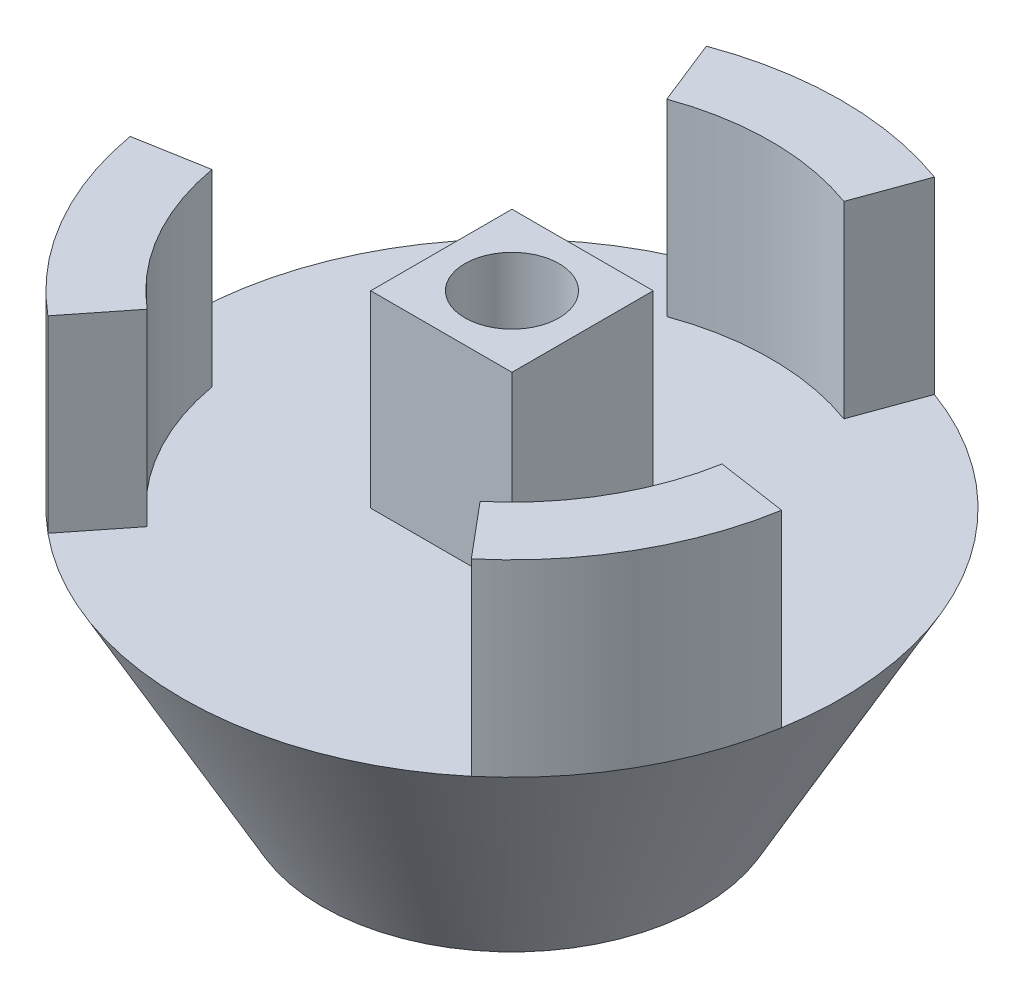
ISO-10303-21;
HEADER;
FILE_DESCRIPTION(('STEP AP214'),'2;1');
FILE_NAME('part.step','',(''),(''),'','','');
FILE_SCHEMA(('AUTOMOTIVE_DESIGN { 1 0 10303 214 1 1 1 1 }'));
ENDSEC;
DATA;
#1=APPLICATION_CONTEXT('core data for automotive mechanical design processes');
#2=APPLICATION_PROTOCOL_DEFINITION('international standard','automotive_design',2000,#1);
#3=PRODUCT_CONTEXT('',#1,'mechanical');
#4=PRODUCT('Part','Part','',(#3));
#5=PRODUCT_RELATED_PRODUCT_CATEGORY('part','',(#4));
#6=PRODUCT_DEFINITION_FORMATION('','',#4);
#7=PRODUCT_DEFINITION_CONTEXT('part definition',#1,'design');
#8=PRODUCT_DEFINITION('design','',#6,#7);
#9=PRODUCT_DEFINITION_SHAPE('','',#8);
#10=(LENGTH_UNIT() NAMED_UNIT(*) SI_UNIT(.MILLI.,.METRE.));
#11=(NAMED_UNIT(*) PLANE_ANGLE_UNIT() SI_UNIT($,.RADIAN.));
#12=(NAMED_UNIT(*) SI_UNIT($,.STERADIAN.) SOLID_ANGLE_UNIT());
#13=UNCERTAINTY_MEASURE_WITH_UNIT(LENGTH_MEASURE(1.E-05),#10,'distance_accuracy_value','');
#14=(GEOMETRIC_REPRESENTATION_CONTEXT(3) GLOBAL_UNCERTAINTY_ASSIGNED_CONTEXT((#13)) GLOBAL_UNIT_ASSIGNED_CONTEXT((#10,
#11,#12)) REPRESENTATION_CONTEXT('',''));
#15=CARTESIAN_POINT('',(0.,0.,0.));
#16=DIRECTION('',(0.,0.,1.));
#17=DIRECTION('',(1.,0.,0.));
#18=AXIS2_PLACEMENT_3D('',#15,#16,#17);
#19=CARTESIAN_POINT('',(0.,13.4937500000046,0.));
#20=DIRECTION('',(0.,1.,0.));
#21=DIRECTION('',(-1.,0.,0.));
#22=AXIS2_PLACEMENT_3D('',#19,#20,#21);
#23=PLANE('',#22);
#24=DIRECTION('',(-1.,0.,0.));
#25=VECTOR('',#24,1.);
#26=CARTESIAN_POINT('',(-3.81000000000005,13.4937500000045,-3.81));
#27=LINE('',#26,#25);
#28=CARTESIAN_POINT('',(3.80999999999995,13.4937500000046,-3.81));
#29=VERTEX_POINT('',#28);
#30=CARTESIAN_POINT('',(-3.81000000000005,13.4937500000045,-3.81));
#31=VERTEX_POINT('',#30);
#32=EDGE_CURVE('E241',#29,#31,#27,.T.);
#33=ORIENTED_EDGE('',*,*,#32,.F.);
#34=DIRECTION('',(0.,0.,-1.));
#35=VECTOR('',#34,1.);
#36=CARTESIAN_POINT('',(3.80999999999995,13.4937500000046,3.81));
#37=LINE('',#36,#35);
#38=CARTESIAN_POINT('',(3.80999999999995,13.4937500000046,3.81));
#39=VERTEX_POINT('',#38);
#40=EDGE_CURVE('E227',#39,#29,#37,.T.);
#41=ORIENTED_EDGE('',*,*,#40,.F.);
#42=DIRECTION('',(1.,0.,0.));
#43=VECTOR('',#42,1.);
#44=CARTESIAN_POINT('',(-3.81000000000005,13.4937500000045,3.81));
#45=LINE('',#44,#43);
#46=CARTESIAN_POINT('',(-3.81000000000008,13.4937500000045,3.81));
#47=VERTEX_POINT('',#46);
#48=EDGE_CURVE('E232',#47,#39,#45,.T.);
#49=ORIENTED_EDGE('',*,*,#48,.F.);
#50=DIRECTION('',(0.,0.,1.));
#51=VECTOR('',#50,1.);
#52=CARTESIAN_POINT('',(-3.81000000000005,13.4937500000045,3.81));
#53=LINE('',#52,#51);
#54=EDGE_CURVE('E243',#31,#47,#53,.T.);
#55=ORIENTED_EDGE('',*,*,#54,.F.);
#56=EDGE_LOOP('',(#33,#41,#49,#55));
#57=FACE_BOUND('',#56,.T.);
#58=CARTESIAN_POINT('',(0.,13.4937500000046,0.));
#59=DIRECTION('',(0.,-1.,0.));
#60=DIRECTION('',(1.,0.,0.));
#61=AXIS2_PLACEMENT_3D('',#58,#59,#60);
#62=CIRCLE('',#61,13.97);
#63=CARTESIAN_POINT('',(-8.97974290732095,13.4937500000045,10.7016408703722));
#64=VERTEX_POINT('',#63);
#65=CARTESIAN_POINT('',(-13.7577643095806,13.4937500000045,2.42586504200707));
#66=VERTEX_POINT('',#65);
#67=EDGE_CURVE('E342',#64,#66,#62,.T.);
#68=ORIENTED_EDGE('',*,*,#67,.F.);
#69=DIRECTION('',(0.620718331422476,0.,-0.784033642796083));
#70=VECTOR('',#69,1.);
#71=CARTESIAN_POINT('',(-11.3454331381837,13.4937500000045,13.6897606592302));
#72=LINE('',#71,#70);
#73=CARTESIAN_POINT('',(-11.3454331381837,13.4937500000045,13.6897606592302));
#74=VERTEX_POINT('',#73);
#75=EDGE_CURVE('E341',#74,#64,#72,.T.);
#76=ORIENTED_EDGE('',*,*,#75,.F.);
#77=CARTESIAN_POINT('',(0.,13.4937500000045,0.));
#78=DIRECTION('',(0.,-1.,0.));
#79=DIRECTION('',(1.,0.,0.));
#80=AXIS2_PLACEMENT_3D('',#77,#78,#79);
#81=CIRCLE('',#80,17.78);
#82=CARTESIAN_POINT('',(11.4287637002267,13.4937500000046,13.6202701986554));
#83=VERTEX_POINT('',#82);
#84=EDGE_CURVE('E337',#83,#74,#81,.T.);
#85=ORIENTED_EDGE('',*,*,#84,.F.);
#86=DIRECTION('',(0.642787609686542,0.,0.766044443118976));
#87=VECTOR('',#86,1.);
#88=CARTESIAN_POINT('',(8.97974290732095,13.4937500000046,10.7016408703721));
#89=LINE('',#88,#87);
#90=CARTESIAN_POINT('',(8.97974290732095,13.4937500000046,10.7016408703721));
#91=VERTEX_POINT('',#90);
#92=EDGE_CURVE('E181',#91,#83,#89,.T.);
#93=ORIENTED_EDGE('',*,*,#92,.F.);
#94=CARTESIAN_POINT('',(0.,13.4937500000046,0.));
#95=DIRECTION('',(0.,-1.,0.));
#96=DIRECTION('',(1.,0.,0.));
#97=AXIS2_PLACEMENT_3D('',#94,#95,#96);
#98=CIRCLE('',#97,13.97);
#99=CARTESIAN_POINT('',(13.7577643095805,13.4937500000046,2.42586504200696));
#100=VERTEX_POINT('',#99);
#101=EDGE_CURVE('E188',#100,#91,#98,.T.);
#102=ORIENTED_EDGE('',*,*,#101,.F.);
#103=DIRECTION('',(-0.989352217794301,0.,-0.145541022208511));
#104=VECTOR('',#103,1.);
#105=CARTESIAN_POINT('',(17.5283970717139,13.4937500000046,2.98055298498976));
#106=LINE('',#105,#104);
#107=CARTESIAN_POINT('',(17.5283970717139,13.4937500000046,2.98055298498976));
#108=VERTEX_POINT('',#107);
#109=EDGE_CURVE('E171',#108,#100,#106,.T.);
#110=ORIENTED_EDGE('',*,*,#109,.F.);
#111=CARTESIAN_POINT('',(6.0811181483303,13.4937500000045,-16.7077347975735));
#112=VERTEX_POINT('',#111);
#113=EDGE_CURVE('E261',#112,#108,#81,.T.);
#114=ORIENTED_EDGE('',*,*,#113,.F.);
#115=DIRECTION('',(0.342020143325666,0.,-0.93969262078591));
#116=VECTOR('',#115,1.);
#117=CARTESIAN_POINT('',(4.7780214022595,13.4937500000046,-13.1275059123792));
#118=LINE('',#117,#116);
#119=CARTESIAN_POINT('',(4.7780214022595,13.4937500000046,-13.1275059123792));
#120=VERTEX_POINT('',#119);
#121=EDGE_CURVE('E205',#120,#112,#118,.T.);
#122=ORIENTED_EDGE('',*,*,#121,.F.);
#123=CARTESIAN_POINT('',(0.,13.4937500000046,0.));
#124=DIRECTION('',(0.,-1.,0.));
#125=DIRECTION('',(1.,0.,0.));
#126=AXIS2_PLACEMENT_3D('',#123,#124,#125);
#127=CIRCLE('',#126,13.97);
#128=CARTESIAN_POINT('',(-4.7780214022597,13.4937500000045,-13.1275059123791));
#129=VERTEX_POINT('',#128);
#130=EDGE_CURVE('E213',#129,#120,#127,.T.);
#131=ORIENTED_EDGE('',*,*,#130,.F.);
#132=DIRECTION('',(0.368633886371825,0.,0.929574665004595));
#133=VECTOR('',#132,1.);
#134=CARTESIAN_POINT('',(-6.18296393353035,13.4937500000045,-16.6703136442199));
#135=LINE('',#134,#133);
#136=CARTESIAN_POINT('',(-6.18296393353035,13.4937500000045,-16.6703136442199));
#137=VERTEX_POINT('',#136);
#138=EDGE_CURVE('E200',#137,#129,#135,.T.);
#139=ORIENTED_EDGE('',*,*,#138,.F.);
#140=CARTESIAN_POINT('',(-17.5098818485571,13.4937500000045,3.0874645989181));
#141=VERTEX_POINT('',#140);
#142=EDGE_CURVE('E256',#141,#137,#81,.T.);
#143=ORIENTED_EDGE('',*,*,#142,.F.);
#144=DIRECTION('',(-0.984807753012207,0.,0.173648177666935));
#145=VECTOR('',#144,1.);
#146=CARTESIAN_POINT('',(-13.7577643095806,13.4937500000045,2.42586504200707));
#147=LINE('',#146,#145);
#148=EDGE_CURVE('E163',#66,#141,#147,.T.);
#149=ORIENTED_EDGE('',*,*,#148,.F.);
#150=EDGE_LOOP('',(#68,#76,#85,#93,#102,#110,#114,#122,#131,#139,#143,#149));
#151=FACE_BOUND('',#150,.T.);
#152=ADVANCED_FACE('F32',(#57,#151),#23,.T.);
#153=CARTESIAN_POINT('',(3.8862,7.14375000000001,0.));
#154=DIRECTION('',(0.,-1.,0.));
#155=DIRECTION('',(1.,0.,0.));
#156=AXIS2_PLACEMENT_3D('',#153,#154,#155);
#157=PLANE('',#156);
#158=CARTESIAN_POINT('',(0.,7.14374999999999,0.));
#159=DIRECTION('',(0.,-1.,0.));
#160=DIRECTION('',(1.,0.,0.));
#161=AXIS2_PLACEMENT_3D('',#158,#159,#160);
#162=CIRCLE('',#161,2.54);
#163=CARTESIAN_POINT('',(2.53999999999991,7.14375,0.));
#164=VERTEX_POINT('',#163);
#165=EDGE_CURVE('E345',#164,#164,#162,.T.);
#166=ORIENTED_EDGE('',*,*,#165,.F.);
#167=EDGE_LOOP('',(#166));
#168=FACE_BOUND('',#167,.T.);
#169=CARTESIAN_POINT('',(0.,7.14375,0.));
#170=DIRECTION('',(0.,-1.,0.));
#171=DIRECTION('',(1.,0.,0.));
#172=AXIS2_PLACEMENT_3D('',#169,#170,#171);
#173=CIRCLE('',#172,3.88620000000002);
#174=CARTESIAN_POINT('',(3.8862,7.14375000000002,0.));
#175=VERTEX_POINT('',#174);
#176=EDGE_CURVE('E11',#175,#175,#173,.T.);
#177=ORIENTED_EDGE('',*,*,#176,.T.);
#178=EDGE_LOOP('',(#177));
#179=FACE_BOUND('',#178,.T.);
#180=ADVANCED_FACE('F34',(#168,#179),#157,.T.);
#181=CARTESIAN_POINT('',(1.22317137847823E-12,-350.330206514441,0.));
#182=DIRECTION('',(0.,-1.,0.));
#183=DIRECTION('',(1.,0.,0.));
#184=AXIS2_PLACEMENT_3D('',#181,#182,#183);
#185=CYLINDRICAL_SURFACE('',#184,3.88620000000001);
#186=CARTESIAN_POINT('',(0.,0.761999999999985,0.));
#187=DIRECTION('',(0.,-1.,0.));
#188=DIRECTION('',(1.,0.,0.));
#189=AXIS2_PLACEMENT_3D('',#186,#187,#188);
#190=CIRCLE('',#189,3.8862);
#191=CARTESIAN_POINT('',(3.8862,0.761999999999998,0.));
#192=VERTEX_POINT('',#191);
#193=EDGE_CURVE('E40',#192,#192,#190,.T.);
#194=ORIENTED_EDGE('',*,*,#193,.T.);
#195=EDGE_LOOP('',(#194));
#196=FACE_BOUND('',#195,.T.);
#197=ORIENTED_EDGE('',*,*,#176,.F.);
#198=EDGE_LOOP('',(#197));
#199=FACE_BOUND('',#198,.T.);
#200=ADVANCED_FACE('F269',(#196,#199),#185,.F.);
#201=CARTESIAN_POINT('',(0.,0.762,0.));
#202=DIRECTION('',(0.,-1.,0.));
#203=DIRECTION('',(1.,0.,0.));
#204=AXIS2_PLACEMENT_3D('',#201,#202,#203);
#205=TOROIDAL_SURFACE('',#204,4.6482,0.762);
#206=CARTESIAN_POINT('',(0.,0.,0.));
#207=DIRECTION('',(0.,-1.,0.));
#208=DIRECTION('',(1.,0.,0.));
#209=AXIS2_PLACEMENT_3D('',#206,#207,#208);
#210=CIRCLE('',#209,4.64820000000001);
#211=CARTESIAN_POINT('',(4.64820000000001,0.,0.));
#212=VERTEX_POINT('',#211);
#213=EDGE_CURVE('E264',#212,#212,#210,.T.);
#214=ORIENTED_EDGE('',*,*,#213,.T.);
#215=EDGE_LOOP('',(#214));
#216=FACE_BOUND('',#215,.T.);
#217=ORIENTED_EDGE('',*,*,#193,.F.);
#218=EDGE_LOOP('',(#217));
#219=FACE_BOUND('',#218,.T.);
#220=ADVANCED_FACE('F272',(#216,#219),#205,.T.);
#221=CARTESIAN_POINT('',(4.64820000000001,0.,0.));
#222=DIRECTION('',(0.,-1.,0.));
#223=DIRECTION('',(1.,0.,0.));
#224=AXIS2_PLACEMENT_3D('',#221,#222,#223);
#225=PLANE('',#224);
#226=CARTESIAN_POINT('',(0.,0.,0.));
#227=DIRECTION('',(0.,-1.,0.));
#228=DIRECTION('',(1.,0.,0.));
#229=AXIS2_PLACEMENT_3D('',#226,#227,#228);
#230=CIRCLE('',#229,10.2362);
#231=CARTESIAN_POINT('',(10.2362,0.,0.));
#232=VERTEX_POINT('',#231);
#233=EDGE_CURVE('E260',#232,#232,#230,.T.);
#234=ORIENTED_EDGE('',*,*,#233,.T.);
#235=EDGE_LOOP('',(#234));
#236=FACE_BOUND('',#235,.T.);
#237=ORIENTED_EDGE('',*,*,#213,.F.);
#238=EDGE_LOOP('',(#237));
#239=FACE_BOUND('',#238,.T.);
#240=ADVANCED_FACE('F274',(#236,#239),#225,.T.);
#241=CARTESIAN_POINT('',(0.,0.,0.));
#242=DIRECTION('',(0.,1.,0.));
#243=DIRECTION('',(-1.,0.,0.));
#244=AXIS2_PLACEMENT_3D('',#241,#242,#243);
#245=CONICAL_SURFACE('',#244,10.2362,0.509771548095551);
#246=EDGE_CURVE('E257',#137,#112,#81,.T.);
#247=ORIENTED_EDGE('',*,*,#246,.T.);
#248=ORIENTED_EDGE('',*,*,#113,.T.);
#249=CARTESIAN_POINT('',(0.,13.4937500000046,0.));
#250=DIRECTION('',(0.,1.,0.));
#251=DIRECTION('',(-1.,0.,0.));
#252=AXIS2_PLACEMENT_3D('',#249,#250,#251);
#253=CIRCLE('',#252,17.7800000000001);
#254=EDGE_CURVE('E169',#83,#108,#253,.T.);
#255=ORIENTED_EDGE('',*,*,#254,.F.);
#256=ORIENTED_EDGE('',*,*,#84,.T.);
#257=CARTESIAN_POINT('',(0.,13.4937500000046,0.));
#258=DIRECTION('',(0.,1.,0.));
#259=DIRECTION('',(-1.,0.,0.));
#260=AXIS2_PLACEMENT_3D('',#257,#258,#259);
#261=CIRCLE('',#260,17.7800000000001);
#262=EDGE_CURVE('E167',#141,#74,#261,.T.);
#263=ORIENTED_EDGE('',*,*,#262,.F.);
#264=ORIENTED_EDGE('',*,*,#142,.T.);
#265=EDGE_LOOP('',(#247,#248,#255,#256,#263,#264));
#266=FACE_BOUND('',#265,.T.);
#267=ORIENTED_EDGE('',*,*,#233,.F.);
#268=EDGE_LOOP('',(#267));
#269=FACE_BOUND('',#268,.T.);
#270=ADVANCED_FACE('F281',(#266,#269),#245,.T.);
#271=CARTESIAN_POINT('',(3.80999999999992,23.6537500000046,3.81));
#272=DIRECTION('',(-1.,0.,0.));
#273=DIRECTION('',(0.,-1.,0.));
#274=AXIS2_PLACEMENT_3D('',#271,#272,#273);
#275=PLANE('',#274);
#276=ORIENTED_EDGE('',*,*,#40,.T.);
#277=DIRECTION('',(0.,-1.,0.));
#278=VECTOR('',#277,1.);
#279=CARTESIAN_POINT('',(3.80999999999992,23.6537500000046,-3.81));
#280=LINE('',#279,#278);
#281=CARTESIAN_POINT('',(3.80999999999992,23.6537500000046,-3.81));
#282=VERTEX_POINT('',#281);
#283=EDGE_CURVE('E254',#282,#29,#280,.T.);
#284=ORIENTED_EDGE('',*,*,#283,.F.);
#285=DIRECTION('',(0.,0.,-1.));
#286=VECTOR('',#285,1.);
#287=CARTESIAN_POINT('',(3.80999999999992,23.6537500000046,3.81));
#288=LINE('',#287,#286);
#289=CARTESIAN_POINT('',(3.80999999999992,23.6537500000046,3.81));
#290=VERTEX_POINT('',#289);
#291=EDGE_CURVE('E228',#290,#282,#288,.T.);
#292=ORIENTED_EDGE('',*,*,#291,.F.);
#293=DIRECTION('',(0.,-1.,0.));
#294=VECTOR('',#293,1.);
#295=CARTESIAN_POINT('',(3.80999999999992,23.6537500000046,3.81));
#296=LINE('',#295,#294);
#297=EDGE_CURVE('E238',#290,#39,#296,.T.);
#298=ORIENTED_EDGE('',*,*,#297,.T.);
#299=EDGE_LOOP('',(#276,#284,#292,#298));
#300=FACE_BOUND('',#299,.T.);
#301=ADVANCED_FACE('F295',(#300),#275,.F.);
#302=CARTESIAN_POINT('',(-3.81000000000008,23.6537500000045,-3.81));
#303=DIRECTION('',(0.,0.,1.));
#304=DIRECTION('',(1.,0.,0.));
#305=AXIS2_PLACEMENT_3D('',#302,#303,#304);
#306=PLANE('',#305);
#307=ORIENTED_EDGE('',*,*,#32,.T.);
#308=DIRECTION('',(0.,-1.,0.));
#309=VECTOR('',#308,1.);
#310=CARTESIAN_POINT('',(-3.81000000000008,23.6537500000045,-3.81));
#311=LINE('',#310,#309);
#312=CARTESIAN_POINT('',(-3.81000000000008,23.6537500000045,-3.81));
#313=VERTEX_POINT('',#312);
#314=EDGE_CURVE('E251',#313,#31,#311,.T.);
#315=ORIENTED_EDGE('',*,*,#314,.F.);
#316=DIRECTION('',(-1.,0.,0.));
#317=VECTOR('',#316,1.);
#318=CARTESIAN_POINT('',(-3.81000000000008,23.6537500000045,-3.81));
#319=LINE('',#318,#317);
#320=EDGE_CURVE('E231',#282,#313,#319,.T.);
#321=ORIENTED_EDGE('',*,*,#320,.F.);
#322=ORIENTED_EDGE('',*,*,#283,.T.);
#323=EDGE_LOOP('',(#307,#315,#321,#322));
#324=FACE_BOUND('',#323,.T.);
#325=ADVANCED_FACE('F302',(#324),#306,.F.);
#326=CARTESIAN_POINT('',(-3.81000000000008,23.6537500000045,3.81));
#327=DIRECTION('',(1.,0.,0.));
#328=DIRECTION('',(0.,1.,0.));
#329=AXIS2_PLACEMENT_3D('',#326,#327,#328);
#330=PLANE('',#329);
#331=ORIENTED_EDGE('',*,*,#54,.T.);
#332=DIRECTION('',(0.,-1.,0.));
#333=VECTOR('',#332,1.);
#334=CARTESIAN_POINT('',(-3.81000000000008,23.6537500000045,3.81));
#335=LINE('',#334,#333);
#336=CARTESIAN_POINT('',(-3.81000000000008,23.6537500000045,3.81));
#337=VERTEX_POINT('',#336);
#338=EDGE_CURVE('E249',#337,#47,#335,.T.);
#339=ORIENTED_EDGE('',*,*,#338,.F.);
#340=DIRECTION('',(0.,0.,1.));
#341=VECTOR('',#340,1.);
#342=CARTESIAN_POINT('',(-3.81000000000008,23.6537500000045,3.81));
#343=LINE('',#342,#341);
#344=EDGE_CURVE('E234',#313,#337,#343,.T.);
#345=ORIENTED_EDGE('',*,*,#344,.F.);
#346=ORIENTED_EDGE('',*,*,#314,.T.);
#347=EDGE_LOOP('',(#331,#339,#345,#346));
#348=FACE_BOUND('',#347,.T.);
#349=ADVANCED_FACE('F382',(#348),#330,.F.);
#350=CARTESIAN_POINT('',(-3.81000000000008,23.6537500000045,3.81));
#351=DIRECTION('',(0.,0.,-1.));
#352=DIRECTION('',(-1.,0.,0.));
#353=AXIS2_PLACEMENT_3D('',#350,#351,#352);
#354=PLANE('',#353);
#355=ORIENTED_EDGE('',*,*,#48,.T.);
#356=ORIENTED_EDGE('',*,*,#297,.F.);
#357=DIRECTION('',(1.,0.,0.));
#358=VECTOR('',#357,1.);
#359=CARTESIAN_POINT('',(-3.81000000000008,23.6537500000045,3.81));
#360=LINE('',#359,#358);
#361=EDGE_CURVE('E236',#337,#290,#360,.T.);
#362=ORIENTED_EDGE('',*,*,#361,.F.);
#363=ORIENTED_EDGE('',*,*,#338,.T.);
#364=EDGE_LOOP('',(#355,#356,#362,#363));
#365=FACE_BOUND('',#364,.T.);
#366=ADVANCED_FACE('F369',(#365),#354,.F.);
#367=CARTESIAN_POINT('',(0.,23.6537500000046,0.));
#368=DIRECTION('',(0.,-1.,0.));
#369=DIRECTION('',(1.,0.,0.));
#370=AXIS2_PLACEMENT_3D('',#367,#368,#369);
#371=PLANE('',#370);
#372=CARTESIAN_POINT('',(0.,23.6537500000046,0.));
#373=DIRECTION('',(0.,1.,0.));
#374=DIRECTION('',(0.,0.,1.));
#375=AXIS2_PLACEMENT_3D('',#372,#373,#374);
#376=CIRCLE('',#375,2.54);
#377=CARTESIAN_POINT('',(0.,23.6537500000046,2.54));
#378=VERTEX_POINT('',#377);
#379=EDGE_CURVE('E360',#378,#378,#376,.T.);
#380=ORIENTED_EDGE('',*,*,#379,.F.);
#381=EDGE_LOOP('',(#380));
#382=FACE_BOUND('',#381,.T.);
#383=ORIENTED_EDGE('',*,*,#291,.T.);
#384=ORIENTED_EDGE('',*,*,#320,.T.);
#385=ORIENTED_EDGE('',*,*,#344,.T.);
#386=ORIENTED_EDGE('',*,*,#361,.T.);
#387=EDGE_LOOP('',(#383,#384,#385,#386));
#388=FACE_BOUND('',#387,.T.);
#389=ADVANCED_FACE('F366',(#382,#388),#371,.F.);
#390=CARTESIAN_POINT('',(0.,23.6537500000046,0.));
#391=DIRECTION('',(0.,-1.,0.));
#392=DIRECTION('',(1.,0.,0.));
#393=AXIS2_PLACEMENT_3D('',#390,#391,#392);
#394=CYLINDRICAL_SURFACE('',#393,17.78);
#395=ORIENTED_EDGE('',*,*,#246,.F.);
#396=DIRECTION('',(0.,-1.,0.));
#397=VECTOR('',#396,1.);
#398=CARTESIAN_POINT('',(-6.18296393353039,23.6537500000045,-16.6703136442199));
#399=LINE('',#398,#397);
#400=CARTESIAN_POINT('',(-6.18296393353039,23.6537500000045,-16.6703136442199));
#401=VERTEX_POINT('',#400);
#402=EDGE_CURVE('E224',#401,#137,#399,.T.);
#403=ORIENTED_EDGE('',*,*,#402,.F.);
#404=CARTESIAN_POINT('',(0.,23.6537500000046,0.));
#405=DIRECTION('',(0.,1.,0.));
#406=DIRECTION('',(-1.,0.,0.));
#407=AXIS2_PLACEMENT_3D('',#404,#405,#406);
#408=CIRCLE('',#407,17.78);
#409=CARTESIAN_POINT('',(6.08111814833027,23.6537500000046,-16.7077347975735));
#410=VERTEX_POINT('',#409);
#411=EDGE_CURVE('E201',#410,#401,#408,.T.);
#412=ORIENTED_EDGE('',*,*,#411,.F.);
#413=DIRECTION('',(0.,-1.,0.));
#414=VECTOR('',#413,1.);
#415=CARTESIAN_POINT('',(6.08111814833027,23.6537500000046,-16.7077347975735));
#416=LINE('',#415,#414);
#417=EDGE_CURVE('E211',#410,#112,#416,.T.);
#418=ORIENTED_EDGE('',*,*,#417,.T.);
#419=EDGE_LOOP('',(#395,#403,#412,#418));
#420=FACE_BOUND('',#419,.T.);
#421=ADVANCED_FACE('F316',(#420),#394,.T.);
#422=CARTESIAN_POINT('',(-6.18296393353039,23.6537500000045,-16.6703136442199));
#423=DIRECTION('',(0.929574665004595,0.,-0.368633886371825));
#424=DIRECTION('',(-0.368633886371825,0.,-0.929574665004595));
#425=AXIS2_PLACEMENT_3D('',#422,#423,#424);
#426=PLANE('',#425);
#427=ORIENTED_EDGE('',*,*,#138,.T.);
#428=DIRECTION('',(0.,-1.,0.));
#429=VECTOR('',#428,1.);
#430=CARTESIAN_POINT('',(-4.77802140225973,23.6537500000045,-13.1275059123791));
#431=LINE('',#430,#429);
#432=CARTESIAN_POINT('',(-4.77802140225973,23.6537500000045,-13.1275059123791));
#433=VERTEX_POINT('',#432);
#434=EDGE_CURVE('E221',#433,#129,#431,.T.);
#435=ORIENTED_EDGE('',*,*,#434,.F.);
#436=DIRECTION('',(0.368633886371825,0.,0.929574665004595));
#437=VECTOR('',#436,1.);
#438=CARTESIAN_POINT('',(-6.18296393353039,23.6537500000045,-16.6703136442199));
#439=LINE('',#438,#437);
#440=EDGE_CURVE('E204',#401,#433,#439,.T.);
#441=ORIENTED_EDGE('',*,*,#440,.F.);
#442=ORIENTED_EDGE('',*,*,#402,.T.);
#443=EDGE_LOOP('',(#427,#435,#441,#442));
#444=FACE_BOUND('',#443,.T.);
#445=ADVANCED_FACE('F325',(#444),#426,.F.);
#446=CARTESIAN_POINT('',(0.,23.6537500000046,0.));
#447=DIRECTION('',(0.,-1.,0.));
#448=DIRECTION('',(1.,0.,0.));
#449=AXIS2_PLACEMENT_3D('',#446,#447,#448);
#450=CYLINDRICAL_SURFACE('',#449,13.97);
#451=ORIENTED_EDGE('',*,*,#130,.T.);
#452=DIRECTION('',(0.,-1.,0.));
#453=VECTOR('',#452,1.);
#454=CARTESIAN_POINT('',(4.77802140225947,23.6537500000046,-13.1275059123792));
#455=LINE('',#454,#453);
#456=CARTESIAN_POINT('',(4.77802140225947,23.6537500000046,-13.1275059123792));
#457=VERTEX_POINT('',#456);
#458=EDGE_CURVE('E218',#457,#120,#455,.T.);
#459=ORIENTED_EDGE('',*,*,#458,.F.);
#460=CARTESIAN_POINT('',(0.,23.6537500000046,0.));
#461=DIRECTION('',(0.,-1.,0.));
#462=DIRECTION('',(1.,0.,0.));
#463=AXIS2_PLACEMENT_3D('',#460,#461,#462);
#464=CIRCLE('',#463,13.97);
#465=EDGE_CURVE('E207',#433,#457,#464,.T.);
#466=ORIENTED_EDGE('',*,*,#465,.F.);
#467=ORIENTED_EDGE('',*,*,#434,.T.);
#468=EDGE_LOOP('',(#451,#459,#466,#467));
#469=FACE_BOUND('',#468,.T.);
#470=ADVANCED_FACE('F328',(#469),#450,.F.);
#471=CARTESIAN_POINT('',(4.77802140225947,23.6537500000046,-13.1275059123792));
#472=DIRECTION('',(-0.939692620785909,0.,-0.342020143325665));
#473=DIRECTION('',(-0.342020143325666,0.,0.93969262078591));
#474=AXIS2_PLACEMENT_3D('',#471,#472,#473);
#475=PLANE('',#474);
#476=ORIENTED_EDGE('',*,*,#121,.T.);
#477=ORIENTED_EDGE('',*,*,#417,.F.);
#478=DIRECTION('',(0.342020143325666,0.,-0.93969262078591));
#479=VECTOR('',#478,1.);
#480=CARTESIAN_POINT('',(4.77802140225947,23.6537500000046,-13.1275059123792));
#481=LINE('',#480,#479);
#482=EDGE_CURVE('E209',#457,#410,#481,.T.);
#483=ORIENTED_EDGE('',*,*,#482,.F.);
#484=ORIENTED_EDGE('',*,*,#458,.T.);
#485=EDGE_LOOP('',(#476,#477,#483,#484));
#486=FACE_BOUND('',#485,.T.);
#487=ADVANCED_FACE('F334',(#486),#475,.F.);
#488=CARTESIAN_POINT('',(0.,23.6537500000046,0.));
#489=DIRECTION('',(0.,1.,0.));
#490=DIRECTION('',(-1.,0.,0.));
#491=AXIS2_PLACEMENT_3D('',#488,#489,#490);
#492=PLANE('',#491);
#493=ORIENTED_EDGE('',*,*,#411,.T.);
#494=ORIENTED_EDGE('',*,*,#440,.T.);
#495=ORIENTED_EDGE('',*,*,#465,.T.);
#496=ORIENTED_EDGE('',*,*,#482,.T.);
#497=EDGE_LOOP('',(#493,#494,#495,#496));
#498=FACE_BOUND('',#497,.T.);
#499=ADVANCED_FACE('F332',(#498),#492,.T.);
#500=CARTESIAN_POINT('',(0.,23.6537500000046,0.));
#501=DIRECTION('',(0.,-1.,0.));
#502=DIRECTION('',(1.,0.,0.));
#503=AXIS2_PLACEMENT_3D('',#500,#501,#502);
#504=CYLINDRICAL_SURFACE('',#503,17.7800000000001);
#505=ORIENTED_EDGE('',*,*,#254,.T.);
#506=DIRECTION('',(0.,-1.,0.));
#507=VECTOR('',#506,1.);
#508=CARTESIAN_POINT('',(17.5283970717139,23.6537500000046,2.98055298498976));
#509=LINE('',#508,#507);
#510=CARTESIAN_POINT('',(17.5283970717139,23.6537500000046,2.98055298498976));
#511=VERTEX_POINT('',#510);
#512=EDGE_CURVE('E198',#511,#108,#509,.T.);
#513=ORIENTED_EDGE('',*,*,#512,.F.);
#514=CARTESIAN_POINT('',(0.,23.6537500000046,0.));
#515=DIRECTION('',(0.,1.,0.));
#516=DIRECTION('',(-1.,0.,0.));
#517=AXIS2_PLACEMENT_3D('',#514,#515,#516);
#518=CIRCLE('',#517,17.7800000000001);
#519=CARTESIAN_POINT('',(11.4287637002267,23.6537500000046,13.6202701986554));
#520=VERTEX_POINT('',#519);
#521=EDGE_CURVE('E177',#520,#511,#518,.T.);
#522=ORIENTED_EDGE('',*,*,#521,.F.);
#523=DIRECTION('',(0.,-1.,0.));
#524=VECTOR('',#523,1.);
#525=CARTESIAN_POINT('',(11.4287637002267,23.6537500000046,13.6202701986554));
#526=LINE('',#525,#524);
#527=EDGE_CURVE('E55',#520,#83,#526,.T.);
#528=ORIENTED_EDGE('',*,*,#527,.T.);
#529=EDGE_LOOP('',(#505,#513,#522,#528));
#530=FACE_BOUND('',#529,.T.);
#531=ADVANCED_FACE('F446',(#530),#504,.T.);
#532=CARTESIAN_POINT('',(17.5283970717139,23.6537500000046,2.98055298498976));
#533=DIRECTION('',(-0.145541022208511,0.,0.989352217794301));
#534=DIRECTION('',(0.989352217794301,0.,0.145541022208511));
#535=AXIS2_PLACEMENT_3D('',#532,#533,#534);
#536=PLANE('',#535);
#537=ORIENTED_EDGE('',*,*,#109,.T.);
#538=DIRECTION('',(0.,-1.,0.));
#539=VECTOR('',#538,1.);
#540=CARTESIAN_POINT('',(13.7577643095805,23.6537500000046,2.42586504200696));
#541=LINE('',#540,#539);
#542=CARTESIAN_POINT('',(13.7577643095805,23.6537500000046,2.42586504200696));
#543=VERTEX_POINT('',#542);
#544=EDGE_CURVE('E195',#543,#100,#541,.T.);
#545=ORIENTED_EDGE('',*,*,#544,.F.);
#546=DIRECTION('',(-0.989352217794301,0.,-0.145541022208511));
#547=VECTOR('',#546,1.);
#548=CARTESIAN_POINT('',(17.5283970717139,23.6537500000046,2.98055298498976));
#549=LINE('',#548,#547);
#550=EDGE_CURVE('E180',#511,#543,#549,.T.);
#551=ORIENTED_EDGE('',*,*,#550,.F.);
#552=ORIENTED_EDGE('',*,*,#512,.T.);
#553=EDGE_LOOP('',(#537,#545,#551,#552));
#554=FACE_BOUND('',#553,.T.);
#555=ADVANCED_FACE('F455',(#554),#536,.F.);
#556=CARTESIAN_POINT('',(0.,23.6537500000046,0.));
#557=DIRECTION('',(0.,-1.,0.));
#558=DIRECTION('',(1.,0.,0.));
#559=AXIS2_PLACEMENT_3D('',#556,#557,#558);
#560=CYLINDRICAL_SURFACE('',#559,13.97);
#561=ORIENTED_EDGE('',*,*,#101,.T.);
#562=DIRECTION('',(0.,-1.,0.));
#563=VECTOR('',#562,1.);
#564=CARTESIAN_POINT('',(8.97974290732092,23.6537500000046,10.7016408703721));
#565=LINE('',#564,#563);
#566=CARTESIAN_POINT('',(8.97974290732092,23.6537500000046,10.7016408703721));
#567=VERTEX_POINT('',#566);
#568=EDGE_CURVE('E192',#567,#91,#565,.T.);
#569=ORIENTED_EDGE('',*,*,#568,.F.);
#570=CARTESIAN_POINT('',(0.,23.6537500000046,0.));
#571=DIRECTION('',(0.,-1.,0.));
#572=DIRECTION('',(1.,0.,0.));
#573=AXIS2_PLACEMENT_3D('',#570,#571,#572);
#574=CIRCLE('',#573,13.97);
#575=EDGE_CURVE('E183',#543,#567,#574,.T.);
#576=ORIENTED_EDGE('',*,*,#575,.F.);
#577=ORIENTED_EDGE('',*,*,#544,.T.);
#578=EDGE_LOOP('',(#561,#569,#576,#577));
#579=FACE_BOUND('',#578,.T.);
#580=ADVANCED_FACE('F464',(#579),#560,.F.);
#581=CARTESIAN_POINT('',(8.97974290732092,23.6537500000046,10.7016408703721));
#582=DIRECTION('',(0.766044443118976,0.,-0.642787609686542));
#583=DIRECTION('',(-0.642787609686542,0.,-0.766044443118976));
#584=AXIS2_PLACEMENT_3D('',#581,#582,#583);
#585=PLANE('',#584);
#586=ORIENTED_EDGE('',*,*,#92,.T.);
#587=ORIENTED_EDGE('',*,*,#527,.F.);
#588=DIRECTION('',(0.642787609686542,0.,0.766044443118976));
#589=VECTOR('',#588,1.);
#590=CARTESIAN_POINT('',(8.97974290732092,23.6537500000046,10.7016408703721));
#591=LINE('',#590,#589);
#592=EDGE_CURVE('E185',#567,#520,#591,.T.);
#593=ORIENTED_EDGE('',*,*,#592,.F.);
#594=ORIENTED_EDGE('',*,*,#568,.T.);
#595=EDGE_LOOP('',(#586,#587,#593,#594));
#596=FACE_BOUND('',#595,.T.);
#597=ADVANCED_FACE('F474',(#596),#585,.F.);
#598=CARTESIAN_POINT('',(0.,23.6537500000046,0.));
#599=DIRECTION('',(0.,1.,0.));
#600=DIRECTION('',(-1.,0.,0.));
#601=AXIS2_PLACEMENT_3D('',#598,#599,#600);
#602=PLANE('',#601);
#603=ORIENTED_EDGE('',*,*,#521,.T.);
#604=ORIENTED_EDGE('',*,*,#550,.T.);
#605=ORIENTED_EDGE('',*,*,#575,.T.);
#606=ORIENTED_EDGE('',*,*,#592,.T.);
#607=EDGE_LOOP('',(#603,#604,#605,#606));
#608=FACE_BOUND('',#607,.T.);
#609=ADVANCED_FACE('F484',(#608),#602,.T.);
#610=CARTESIAN_POINT('',(0.,23.6537500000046,0.));
#611=DIRECTION('',(0.,-1.,0.));
#612=DIRECTION('',(1.,0.,0.));
#613=AXIS2_PLACEMENT_3D('',#610,#611,#612);
#614=CYLINDRICAL_SURFACE('',#613,17.7800000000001);
#615=ORIENTED_EDGE('',*,*,#262,.T.);
#616=DIRECTION('',(0.,-1.,0.));
#617=VECTOR('',#616,1.);
#618=CARTESIAN_POINT('',(-11.3454331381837,23.6537500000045,13.6897606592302));
#619=LINE('',#618,#617);
#620=CARTESIAN_POINT('',(-11.3454331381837,23.6537500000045,13.6897606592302));
#621=VERTEX_POINT('',#620);
#622=EDGE_CURVE('E152',#621,#74,#619,.T.);
#623=ORIENTED_EDGE('',*,*,#622,.F.);
#624=CARTESIAN_POINT('',(0.,23.6537500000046,0.));
#625=DIRECTION('',(0.,1.,0.));
#626=DIRECTION('',(-1.,0.,0.));
#627=AXIS2_PLACEMENT_3D('',#624,#625,#626);
#628=CIRCLE('',#627,17.7800000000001);
#629=CARTESIAN_POINT('',(-17.5098818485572,23.6537500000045,3.0874645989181));
#630=VERTEX_POINT('',#629);
#631=EDGE_CURVE('E158',#630,#621,#628,.T.);
#632=ORIENTED_EDGE('',*,*,#631,.F.);
#633=DIRECTION('',(0.,-1.,0.));
#634=VECTOR('',#633,1.);
#635=CARTESIAN_POINT('',(-17.5098818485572,23.6537500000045,3.0874645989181));
#636=LINE('',#635,#634);
#637=EDGE_CURVE('E47',#630,#141,#636,.T.);
#638=ORIENTED_EDGE('',*,*,#637,.T.);
#639=EDGE_LOOP('',(#615,#623,#632,#638));
#640=FACE_BOUND('',#639,.T.);
#641=ADVANCED_FACE('F165',(#640),#614,.T.);
#642=CARTESIAN_POINT('',(-11.3454331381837,23.6537500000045,13.6897606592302));
#643=DIRECTION('',(-0.784033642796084,0.,-0.620718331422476));
#644=DIRECTION('',(-0.620718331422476,0.,0.784033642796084));
#645=AXIS2_PLACEMENT_3D('',#642,#643,#644);
#646=PLANE('',#645);
#647=ORIENTED_EDGE('',*,*,#75,.T.);
#648=DIRECTION('',(0.,-1.,0.));
#649=VECTOR('',#648,1.);
#650=CARTESIAN_POINT('',(-8.97974290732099,23.6537500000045,10.7016408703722));
#651=LINE('',#650,#649);
#652=CARTESIAN_POINT('',(-8.97974290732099,23.6537500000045,10.7016408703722));
#653=VERTEX_POINT('',#652);
#654=EDGE_CURVE('E154',#653,#64,#651,.T.);
#655=ORIENTED_EDGE('',*,*,#654,.F.);
#656=DIRECTION('',(0.620718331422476,0.,-0.784033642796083));
#657=VECTOR('',#656,1.);
#658=CARTESIAN_POINT('',(-11.3454331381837,23.6537500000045,13.6897606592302));
#659=LINE('',#658,#657);
#660=EDGE_CURVE('E148',#621,#653,#659,.T.);
#661=ORIENTED_EDGE('',*,*,#660,.F.);
#662=ORIENTED_EDGE('',*,*,#622,.T.);
#663=EDGE_LOOP('',(#647,#655,#661,#662));
#664=FACE_BOUND('',#663,.T.);
#665=ADVANCED_FACE('F150',(#664),#646,.F.);
#666=CARTESIAN_POINT('',(0.,23.6537500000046,0.));
#667=DIRECTION('',(0.,-1.,0.));
#668=DIRECTION('',(1.,0.,0.));
#669=AXIS2_PLACEMENT_3D('',#666,#667,#668);
#670=CYLINDRICAL_SURFACE('',#669,13.97);
#671=ORIENTED_EDGE('',*,*,#67,.T.);
#672=DIRECTION('',(0.,-1.,0.));
#673=VECTOR('',#672,1.);
#674=CARTESIAN_POINT('',(-13.7577643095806,23.6537500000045,2.42586504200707));
#675=LINE('',#674,#673);
#676=CARTESIAN_POINT('',(-13.7577643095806,23.6537500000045,2.42586504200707));
#677=VERTEX_POINT('',#676);
#678=EDGE_CURVE('E173',#677,#66,#675,.T.);
#679=ORIENTED_EDGE('',*,*,#678,.F.);
#680=CARTESIAN_POINT('',(0.,23.6537500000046,0.));
#681=DIRECTION('',(0.,-1.,0.));
#682=DIRECTION('',(1.,0.,0.));
#683=AXIS2_PLACEMENT_3D('',#680,#681,#682);
#684=CIRCLE('',#683,13.97);
#685=EDGE_CURVE('E157',#653,#677,#684,.T.);
#686=ORIENTED_EDGE('',*,*,#685,.F.);
#687=ORIENTED_EDGE('',*,*,#654,.T.);
#688=EDGE_LOOP('',(#671,#679,#686,#687));
#689=FACE_BOUND('',#688,.T.);
#690=ADVANCED_FACE('F355',(#689),#670,.F.);
#691=CARTESIAN_POINT('',(-13.7577643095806,23.6537500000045,2.42586504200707));
#692=DIRECTION('',(0.173648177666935,0.,0.984807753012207));
#693=DIRECTION('',(0.984807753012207,0.,-0.173648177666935));
#694=AXIS2_PLACEMENT_3D('',#691,#692,#693);
#695=PLANE('',#694);
#696=ORIENTED_EDGE('',*,*,#148,.T.);
#697=ORIENTED_EDGE('',*,*,#637,.F.);
#698=DIRECTION('',(-0.984807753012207,0.,0.173648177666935));
#699=VECTOR('',#698,1.);
#700=CARTESIAN_POINT('',(-13.7577643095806,23.6537500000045,2.42586504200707));
#701=LINE('',#700,#699);
#702=EDGE_CURVE('E162',#677,#630,#701,.T.);
#703=ORIENTED_EDGE('',*,*,#702,.F.);
#704=ORIENTED_EDGE('',*,*,#678,.T.);
#705=EDGE_LOOP('',(#696,#697,#703,#704));
#706=FACE_BOUND('',#705,.T.);
#707=ADVANCED_FACE('F353',(#706),#695,.F.);
#708=CARTESIAN_POINT('',(0.,23.6537500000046,0.));
#709=DIRECTION('',(0.,1.,0.));
#710=DIRECTION('',(-1.,0.,0.));
#711=AXIS2_PLACEMENT_3D('',#708,#709,#710);
#712=PLANE('',#711);
#713=ORIENTED_EDGE('',*,*,#631,.T.);
#714=ORIENTED_EDGE('',*,*,#660,.T.);
#715=ORIENTED_EDGE('',*,*,#685,.T.);
#716=ORIENTED_EDGE('',*,*,#702,.T.);
#717=EDGE_LOOP('',(#713,#714,#715,#716));
#718=FACE_BOUND('',#717,.T.);
#719=ADVANCED_FACE('F160',(#718),#712,.T.);
#720=CARTESIAN_POINT('',(0.,23.6537500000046,0.));
#721=DIRECTION('',(0.,1.,0.));
#722=DIRECTION('',(0.,0.,1.));
#723=AXIS2_PLACEMENT_3D('',#720,#721,#722);
#724=CYLINDRICAL_SURFACE('',#723,2.54);
#725=ORIENTED_EDGE('',*,*,#165,.T.);
#726=EDGE_LOOP('',(#725));
#727=FACE_BOUND('',#726,.T.);
#728=ORIENTED_EDGE('',*,*,#379,.T.);
#729=EDGE_LOOP('',(#728));
#730=FACE_BOUND('',#729,.T.);
#731=ADVANCED_FACE('F364',(#727,#730),#724,.F.);
#732=CLOSED_SHELL('',(#152,#180,#200,#220,#240,#270,#301,#325,#349,#366,#389,#421,#445,#470,
#487,#499,#531,#555,#580,#597,#609,#641,#665,#690,#707,#719,#731));
#733=MANIFOLD_SOLID_BREP('B2',#732);
#734=ADVANCED_BREP_SHAPE_REPRESENTATION('',(#18,#733),#14);
#735=SHAPE_DEFINITION_REPRESENTATION(#9,#734);
ENDSEC;
END-ISO-10303-21;
